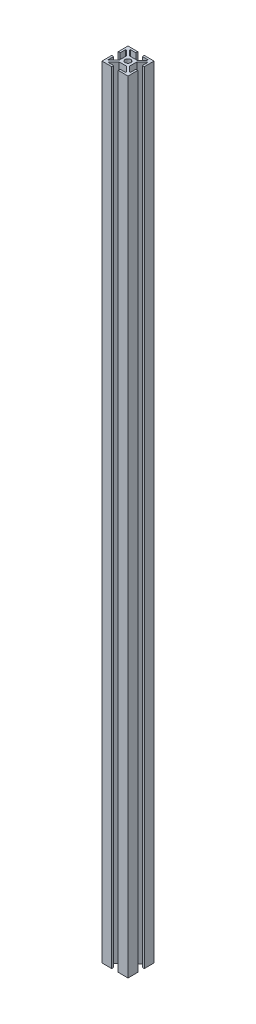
from build123d import *

# Parameters (mm, degrees)
SKETCH1_R           = 2.15
BOSS_EXTRUDE1_DEPTH = 600


with BuildPart() as part:
    # Sketch1 → Boss-Extrude1 (new body)
    with BuildSketch(Plane(origin=(0, 0, 0), x_dir=(1, 0, 0), z_dir=(0, 1, 0))):
        Polygon((-10, 10), (-2.5, 10), (-2.5, 8.499999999), (-6.75, 8.499999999), (-6.75, 7.77515127), (-2.97484873, 4), (2.97484873, 4), (6.75, 7.77515127), (6.75, 8.499999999), (2.5, 8.499999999), (2.5, 10), (10, 10), (10, 2.5), (8.5, 2.5), (8.5, 6.75), (7.846169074, 6.75), (4, 2.903830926), (4, -2.903830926), (7.846169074, -6.75), (8.5, -6.75), (8.5, -2.5), (10, -2.5), (10, -10), (2.5, -10), (2.5, -8.499999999), (6.75, -8.499999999), (6.75, -7.77515127), (2.97484873, -4), (-2.97484873, -4), (-6.75, -7.77515127), (-6.75, -8.499999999), (-2.5, -8.499999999), (-2.5, -10), (-10, -10), (-10, -2.5), (-8.5, -2.5), (-8.5, -6.75), (-7.846169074, -6.75), (-4, -2.903830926), (-4, 2.903830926), (-7.846169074, 6.75), (-8.5, 6.75), (-8.5, 2.5), (-10, 2.5), align=None)
        with Locations(Location((0, 0, 0), (0, 0, 270))):
            Circle(SKETCH1_R, mode=Mode.SUBTRACT)
    extrude(amount=BOSS_EXTRUDE1_DEPTH)


solid = part.part
